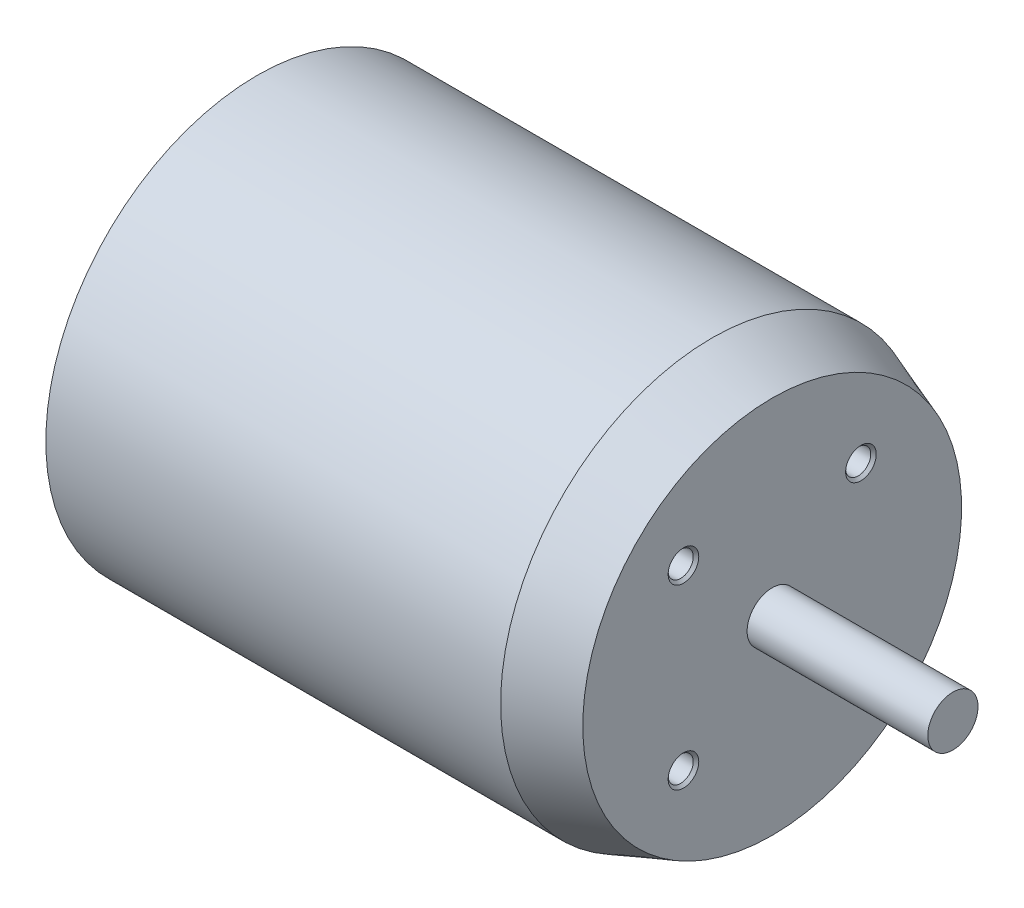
ISO-10303-21;
HEADER;
FILE_DESCRIPTION(('STEP AP214'),'2;1');
FILE_NAME('part.step','',(''),(''),'','','');
FILE_SCHEMA(('AUTOMOTIVE_DESIGN { 1 0 10303 214 1 1 1 1 }'));
ENDSEC;
DATA;
#1=APPLICATION_CONTEXT('core data for automotive mechanical design processes');
#2=APPLICATION_PROTOCOL_DEFINITION('international standard','automotive_design',2000,#1);
#3=PRODUCT_CONTEXT('',#1,'mechanical');
#4=PRODUCT('Part','Part','',(#3));
#5=PRODUCT_RELATED_PRODUCT_CATEGORY('part','',(#4));
#6=PRODUCT_DEFINITION_FORMATION('','',#4);
#7=PRODUCT_DEFINITION_CONTEXT('part definition',#1,'design');
#8=PRODUCT_DEFINITION('design','',#6,#7);
#9=PRODUCT_DEFINITION_SHAPE('','',#8);
#10=(LENGTH_UNIT() NAMED_UNIT(*) SI_UNIT(.MILLI.,.METRE.));
#11=(NAMED_UNIT(*) PLANE_ANGLE_UNIT() SI_UNIT($,.RADIAN.));
#12=(NAMED_UNIT(*) SI_UNIT($,.STERADIAN.) SOLID_ANGLE_UNIT());
#13=UNCERTAINTY_MEASURE_WITH_UNIT(LENGTH_MEASURE(1.E-05),#10,'distance_accuracy_value','');
#14=(GEOMETRIC_REPRESENTATION_CONTEXT(3) GLOBAL_UNCERTAINTY_ASSIGNED_CONTEXT((#13)) GLOBAL_UNIT_ASSIGNED_CONTEXT((#10,
#11,#12)) REPRESENTATION_CONTEXT('',''));
#15=CARTESIAN_POINT('',(0.,0.,0.));
#16=DIRECTION('',(0.,0.,1.));
#17=DIRECTION('',(1.,0.,0.));
#18=AXIS2_PLACEMENT_3D('',#15,#16,#17);
#19=CARTESIAN_POINT('',(58.3,0.,0.));
#20=DIRECTION('',(-1.,0.,0.));
#21=DIRECTION('',(0.,-1.,0.));
#22=AXIS2_PLACEMENT_3D('',#19,#20,#21);
#23=CONICAL_SURFACE('',#22,18.8661785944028,0.349065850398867);
#24=CARTESIAN_POINT('',(52.3,0.,0.));
#25=DIRECTION('',(-1.,0.,0.));
#26=DIRECTION('',(0.,-1.,0.));
#27=AXIS2_PLACEMENT_3D('',#24,#25,#26);
#28=CIRCLE('',#27,21.05);
#29=CARTESIAN_POINT('',(52.3,-21.05,0.));
#30=VERTEX_POINT('',#29);
#31=EDGE_CURVE('E101',#30,#30,#28,.T.);
#32=ORIENTED_EDGE('',*,*,#31,.F.);
#33=EDGE_LOOP('',(#32));
#34=FACE_BOUND('',#33,.T.);
#35=CARTESIAN_POINT('',(58.3,0.,0.));
#36=DIRECTION('',(-1.,0.,0.));
#37=DIRECTION('',(0.,-1.,0.));
#38=AXIS2_PLACEMENT_3D('',#35,#36,#37);
#39=CIRCLE('',#38,18.8661785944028);
#40=CARTESIAN_POINT('',(58.3,-18.8661785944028,0.));
#41=VERTEX_POINT('',#40);
#42=EDGE_CURVE('E11',#41,#41,#39,.T.);
#43=ORIENTED_EDGE('',*,*,#42,.T.);
#44=EDGE_LOOP('',(#43));
#45=FACE_BOUND('',#44,.T.);
#46=ADVANCED_FACE('F37',(#34,#45),#23,.T.);
#47=CARTESIAN_POINT('',(58.3,18.8661785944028,0.));
#48=DIRECTION('',(-1.,0.,0.));
#49=DIRECTION('',(0.,-1.,0.));
#50=AXIS2_PLACEMENT_3D('',#47,#48,#49);
#51=PLANE('',#50);
#52=CARTESIAN_POINT('',(58.3,-8.83883476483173,-8.83883476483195));
#53=DIRECTION('',(1.,0.,0.));
#54=DIRECTION('',(0.,0.,-1.));
#55=AXIS2_PLACEMENT_3D('',#52,#53,#54);
#56=CIRCLE('',#55,1.525);
#57=CARTESIAN_POINT('',(58.3,-8.83883476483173,-10.363834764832));
#58=VERTEX_POINT('',#57);
#59=EDGE_CURVE('E74',#58,#58,#56,.T.);
#60=ORIENTED_EDGE('',*,*,#59,.F.);
#61=EDGE_LOOP('',(#60));
#62=FACE_BOUND('',#61,.T.);
#63=CARTESIAN_POINT('',(58.3,-8.83883476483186,8.83883476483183));
#64=DIRECTION('',(1.,0.,0.));
#65=DIRECTION('',(0.,0.,-1.));
#66=AXIS2_PLACEMENT_3D('',#63,#64,#65);
#67=CIRCLE('',#66,1.525);
#68=CARTESIAN_POINT('',(58.3,-8.83883476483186,7.31383476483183));
#69=VERTEX_POINT('',#68);
#70=EDGE_CURVE('E67',#69,#69,#67,.T.);
#71=ORIENTED_EDGE('',*,*,#70,.F.);
#72=EDGE_LOOP('',(#71));
#73=FACE_BOUND('',#72,.T.);
#74=CARTESIAN_POINT('',(58.3,8.83883476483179,8.83883476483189));
#75=DIRECTION('',(1.,0.,0.));
#76=DIRECTION('',(0.,0.,-1.));
#77=AXIS2_PLACEMENT_3D('',#74,#75,#76);
#78=CIRCLE('',#77,1.525);
#79=CARTESIAN_POINT('',(58.3,8.83883476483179,7.31383476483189));
#80=VERTEX_POINT('',#79);
#81=EDGE_CURVE('E83',#80,#80,#78,.T.);
#82=ORIENTED_EDGE('',*,*,#81,.F.);
#83=EDGE_LOOP('',(#82));
#84=FACE_BOUND('',#83,.T.);
#85=CARTESIAN_POINT('',(58.3,8.83883476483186,-8.83883476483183));
#86=DIRECTION('',(1.,0.,0.));
#87=DIRECTION('',(0.,0.,-1.));
#88=AXIS2_PLACEMENT_3D('',#85,#86,#87);
#89=CIRCLE('',#88,1.525);
#90=CARTESIAN_POINT('',(58.3,8.83883476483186,-10.3638347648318));
#91=VERTEX_POINT('',#90);
#92=EDGE_CURVE('E92',#91,#91,#89,.T.);
#93=ORIENTED_EDGE('',*,*,#92,.F.);
#94=EDGE_LOOP('',(#93));
#95=FACE_BOUND('',#94,.T.);
#96=ORIENTED_EDGE('',*,*,#42,.F.);
#97=EDGE_LOOP('',(#96));
#98=FACE_BOUND('',#97,.T.);
#99=CARTESIAN_POINT('',(58.3,0.,0.));
#100=DIRECTION('',(-1.,0.,0.));
#101=DIRECTION('',(0.,-1.,0.));
#102=AXIS2_PLACEMENT_3D('',#99,#100,#101);
#103=CIRCLE('',#102,2.5);
#104=CARTESIAN_POINT('',(58.3,-2.5,0.));
#105=VERTEX_POINT('',#104);
#106=EDGE_CURVE('E44',#105,#105,#103,.T.);
#107=ORIENTED_EDGE('',*,*,#106,.T.);
#108=EDGE_LOOP('',(#107));
#109=FACE_BOUND('',#108,.T.);
#110=ADVANCED_FACE('F118',(#62,#73,#84,#95,#98,#109),#51,.F.);
#111=CARTESIAN_POINT('',(-55.1177310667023,0.,0.));
#112=DIRECTION('',(-1.,0.,0.));
#113=DIRECTION('',(0.,-1.,0.));
#114=AXIS2_PLACEMENT_3D('',#111,#112,#113);
#115=CYLINDRICAL_SURFACE('',#114,2.5);
#116=ORIENTED_EDGE('',*,*,#106,.F.);
#117=EDGE_LOOP('',(#116));
#118=FACE_BOUND('',#117,.T.);
#119=CARTESIAN_POINT('',(76.3,0.,0.));
#120=DIRECTION('',(-1.,0.,0.));
#121=DIRECTION('',(0.,-1.,0.));
#122=AXIS2_PLACEMENT_3D('',#119,#120,#121);
#123=CIRCLE('',#122,2.5);
#124=CARTESIAN_POINT('',(76.3,-2.5,0.));
#125=VERTEX_POINT('',#124);
#126=EDGE_CURVE('E113',#125,#125,#123,.T.);
#127=ORIENTED_EDGE('',*,*,#126,.T.);
#128=EDGE_LOOP('',(#127));
#129=FACE_BOUND('',#128,.T.);
#130=ADVANCED_FACE('F120',(#118,#129),#115,.T.);
#131=CARTESIAN_POINT('',(76.3,2.5,0.));
#132=DIRECTION('',(-1.,0.,0.));
#133=DIRECTION('',(0.,-1.,0.));
#134=AXIS2_PLACEMENT_3D('',#131,#132,#133);
#135=PLANE('',#134);
#136=ORIENTED_EDGE('',*,*,#126,.F.);
#137=EDGE_LOOP('',(#136));
#138=FACE_BOUND('',#137,.T.);
#139=ADVANCED_FACE('F123',(#138),#135,.F.);
#140=CARTESIAN_POINT('',(0.,0.,0.));
#141=DIRECTION('',(1.,0.,0.));
#142=DIRECTION('',(0.,1.,0.));
#143=AXIS2_PLACEMENT_3D('',#140,#141,#142);
#144=PLANE('',#143);
#145=CARTESIAN_POINT('',(0.,0.,0.));
#146=DIRECTION('',(-1.,0.,0.));
#147=DIRECTION('',(0.,-1.,0.));
#148=AXIS2_PLACEMENT_3D('',#145,#146,#147);
#149=CIRCLE('',#148,5.5);
#150=CARTESIAN_POINT('',(0.,-5.5,0.));
#151=VERTEX_POINT('',#150);
#152=EDGE_CURVE('E110',#151,#151,#149,.T.);
#153=ORIENTED_EDGE('',*,*,#152,.T.);
#154=EDGE_LOOP('',(#153));
#155=FACE_BOUND('',#154,.T.);
#156=ADVANCED_FACE('F128',(#155),#144,.F.);
#157=CARTESIAN_POINT('',(-55.1177310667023,0.,0.));
#158=DIRECTION('',(-1.,0.,0.));
#159=DIRECTION('',(0.,-1.,0.));
#160=AXIS2_PLACEMENT_3D('',#157,#158,#159);
#161=CYLINDRICAL_SURFACE('',#160,5.5);
#162=ORIENTED_EDGE('',*,*,#152,.F.);
#163=EDGE_LOOP('',(#162));
#164=FACE_BOUND('',#163,.T.);
#165=CARTESIAN_POINT('',(7.,0.,0.));
#166=DIRECTION('',(-1.,0.,0.));
#167=DIRECTION('',(0.,-1.,0.));
#168=AXIS2_PLACEMENT_3D('',#165,#166,#167);
#169=CIRCLE('',#168,5.5);
#170=CARTESIAN_POINT('',(7.,-5.5,0.));
#171=VERTEX_POINT('',#170);
#172=EDGE_CURVE('E107',#171,#171,#169,.T.);
#173=ORIENTED_EDGE('',*,*,#172,.T.);
#174=EDGE_LOOP('',(#173));
#175=FACE_BOUND('',#174,.T.);
#176=ADVANCED_FACE('F133',(#164,#175),#161,.T.);
#177=CARTESIAN_POINT('',(7.,5.5,0.));
#178=DIRECTION('',(1.,0.,0.));
#179=DIRECTION('',(0.,1.,0.));
#180=AXIS2_PLACEMENT_3D('',#177,#178,#179);
#181=PLANE('',#180);
#182=ORIENTED_EDGE('',*,*,#172,.F.);
#183=EDGE_LOOP('',(#182));
#184=FACE_BOUND('',#183,.T.);
#185=CARTESIAN_POINT('',(7.,0.,0.));
#186=DIRECTION('',(-1.,0.,0.));
#187=DIRECTION('',(0.,-1.,0.));
#188=AXIS2_PLACEMENT_3D('',#185,#186,#187);
#189=CIRCLE('',#188,21.05);
#190=CARTESIAN_POINT('',(7.,-21.05,0.));
#191=VERTEX_POINT('',#190);
#192=EDGE_CURVE('E104',#191,#191,#189,.T.);
#193=ORIENTED_EDGE('',*,*,#192,.T.);
#194=EDGE_LOOP('',(#193));
#195=FACE_BOUND('',#194,.T.);
#196=ADVANCED_FACE('F150',(#184,#195),#181,.F.);
#197=CARTESIAN_POINT('',(-55.1177310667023,0.,0.));
#198=DIRECTION('',(-1.,0.,0.));
#199=DIRECTION('',(0.,-1.,0.));
#200=AXIS2_PLACEMENT_3D('',#197,#198,#199);
#201=CYLINDRICAL_SURFACE('',#200,21.05);
#202=ORIENTED_EDGE('',*,*,#192,.F.);
#203=EDGE_LOOP('',(#202));
#204=FACE_BOUND('',#203,.T.);
#205=ORIENTED_EDGE('',*,*,#31,.T.);
#206=EDGE_LOOP('',(#205));
#207=FACE_BOUND('',#206,.T.);
#208=ADVANCED_FACE('F147',(#204,#207),#201,.T.);
#209=CARTESIAN_POINT('',(49.8,8.83883476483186,-8.83883476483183));
#210=DIRECTION('',(1.,0.,0.));
#211=DIRECTION('',(0.,0.,-1.));
#212=AXIS2_PLACEMENT_3D('',#209,#210,#211);
#213=CONICAL_SURFACE('',#212,1.24999999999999,1.02974425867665);
#214=CARTESIAN_POINT('',(49.0489242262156,8.83883476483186,-8.83883476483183));
#215=VERTEX_POINT('',#214);
#216=VERTEX_LOOP('',#215);
#217=FACE_BOUND('',#216,.T.);
#218=CARTESIAN_POINT('',(49.8,8.83883476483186,-8.83883476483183));
#219=DIRECTION('',(1.,0.,0.));
#220=DIRECTION('',(0.,0.,-1.));
#221=AXIS2_PLACEMENT_3D('',#218,#219,#220);
#222=CIRCLE('',#221,1.24999999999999);
#223=CARTESIAN_POINT('',(49.8,8.83883476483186,-10.0888347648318));
#224=VERTEX_POINT('',#223);
#225=EDGE_CURVE('E98',#224,#224,#222,.T.);
#226=ORIENTED_EDGE('',*,*,#225,.T.);
#227=EDGE_LOOP('',(#226));
#228=FACE_BOUND('',#227,.T.);
#229=ADVANCED_FACE('F149',(#217,#228),#213,.F.);
#230=CARTESIAN_POINT('',(58.3,8.83883476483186,-8.83883476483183));
#231=DIRECTION('',(1.,0.,0.));
#232=DIRECTION('',(0.,0.,-1.));
#233=AXIS2_PLACEMENT_3D('',#230,#231,#232);
#234=CYLINDRICAL_SURFACE('',#233,1.24999999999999);
#235=ORIENTED_EDGE('',*,*,#225,.F.);
#236=EDGE_LOOP('',(#235));
#237=FACE_BOUND('',#236,.T.);
#238=CARTESIAN_POINT('',(58.025,8.83883476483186,-8.83883476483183));
#239=DIRECTION('',(1.,0.,0.));
#240=DIRECTION('',(0.,0.,-1.));
#241=AXIS2_PLACEMENT_3D('',#238,#239,#240);
#242=CIRCLE('',#241,1.25);
#243=CARTESIAN_POINT('',(58.025,8.83883476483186,-10.0888347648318));
#244=VERTEX_POINT('',#243);
#245=EDGE_CURVE('E95',#244,#244,#242,.T.);
#246=ORIENTED_EDGE('',*,*,#245,.T.);
#247=EDGE_LOOP('',(#246));
#248=FACE_BOUND('',#247,.T.);
#249=ADVANCED_FACE('F157',(#237,#248),#234,.F.);
#250=CARTESIAN_POINT('',(58.3,8.83883476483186,-8.83883476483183));
#251=DIRECTION('',(1.,0.,0.));
#252=DIRECTION('',(0.,0.,-1.));
#253=AXIS2_PLACEMENT_3D('',#250,#251,#252);
#254=CONICAL_SURFACE('',#253,1.525,0.785398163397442);
#255=ORIENTED_EDGE('',*,*,#245,.F.);
#256=EDGE_LOOP('',(#255));
#257=FACE_BOUND('',#256,.T.);
#258=ORIENTED_EDGE('',*,*,#92,.T.);
#259=EDGE_LOOP('',(#258));
#260=FACE_BOUND('',#259,.T.);
#261=ADVANCED_FACE('F201',(#257,#260),#254,.F.);
#262=CARTESIAN_POINT('',(49.8,8.83883476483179,8.83883476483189));
#263=DIRECTION('',(1.,0.,0.));
#264=DIRECTION('',(0.,0.,-1.));
#265=AXIS2_PLACEMENT_3D('',#262,#263,#264);
#266=CONICAL_SURFACE('',#265,1.24999999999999,1.02974425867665);
#267=CARTESIAN_POINT('',(49.0489242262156,8.83883476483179,8.83883476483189));
#268=VERTEX_POINT('',#267);
#269=VERTEX_LOOP('',#268);
#270=FACE_BOUND('',#269,.T.);
#271=CARTESIAN_POINT('',(49.8,8.83883476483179,8.83883476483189));
#272=DIRECTION('',(1.,0.,0.));
#273=DIRECTION('',(0.,0.,-1.));
#274=AXIS2_PLACEMENT_3D('',#271,#272,#273);
#275=CIRCLE('',#274,1.24999999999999);
#276=CARTESIAN_POINT('',(49.8,8.83883476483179,7.5888347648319));
#277=VERTEX_POINT('',#276);
#278=EDGE_CURVE('E89',#277,#277,#275,.T.);
#279=ORIENTED_EDGE('',*,*,#278,.T.);
#280=EDGE_LOOP('',(#279));
#281=FACE_BOUND('',#280,.T.);
#282=ADVANCED_FACE('F212',(#270,#281),#266,.F.);
#283=CARTESIAN_POINT('',(58.3,8.83883476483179,8.83883476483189));
#284=DIRECTION('',(1.,0.,0.));
#285=DIRECTION('',(0.,0.,-1.));
#286=AXIS2_PLACEMENT_3D('',#283,#284,#285);
#287=CYLINDRICAL_SURFACE('',#286,1.24999999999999);
#288=ORIENTED_EDGE('',*,*,#278,.F.);
#289=EDGE_LOOP('',(#288));
#290=FACE_BOUND('',#289,.T.);
#291=CARTESIAN_POINT('',(58.025,8.83883476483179,8.83883476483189));
#292=DIRECTION('',(1.,0.,0.));
#293=DIRECTION('',(0.,0.,-1.));
#294=AXIS2_PLACEMENT_3D('',#291,#292,#293);
#295=CIRCLE('',#294,1.25);
#296=CARTESIAN_POINT('',(58.025,8.83883476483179,7.58883476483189));
#297=VERTEX_POINT('',#296);
#298=EDGE_CURVE('E86',#297,#297,#295,.T.);
#299=ORIENTED_EDGE('',*,*,#298,.T.);
#300=EDGE_LOOP('',(#299));
#301=FACE_BOUND('',#300,.T.);
#302=ADVANCED_FACE('F230',(#290,#301),#287,.F.);
#303=CARTESIAN_POINT('',(58.3,8.83883476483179,8.83883476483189));
#304=DIRECTION('',(1.,0.,0.));
#305=DIRECTION('',(0.,0.,-1.));
#306=AXIS2_PLACEMENT_3D('',#303,#304,#305);
#307=CONICAL_SURFACE('',#306,1.525,0.785398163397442);
#308=ORIENTED_EDGE('',*,*,#298,.F.);
#309=EDGE_LOOP('',(#308));
#310=FACE_BOUND('',#309,.T.);
#311=ORIENTED_EDGE('',*,*,#81,.T.);
#312=EDGE_LOOP('',(#311));
#313=FACE_BOUND('',#312,.T.);
#314=ADVANCED_FACE('F240',(#310,#313),#307,.F.);
#315=CARTESIAN_POINT('',(49.8,-8.83883476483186,8.83883476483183));
#316=DIRECTION('',(1.,0.,0.));
#317=DIRECTION('',(0.,0.,-1.));
#318=AXIS2_PLACEMENT_3D('',#315,#316,#317);
#319=CONICAL_SURFACE('',#318,1.24999999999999,1.02974425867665);
#320=CARTESIAN_POINT('',(49.0489242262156,-8.83883476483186,8.83883476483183));
#321=VERTEX_POINT('',#320);
#322=VERTEX_LOOP('',#321);
#323=FACE_BOUND('',#322,.T.);
#324=CARTESIAN_POINT('',(49.8,-8.83883476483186,8.83883476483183));
#325=DIRECTION('',(1.,0.,0.));
#326=DIRECTION('',(0.,0.,-1.));
#327=AXIS2_PLACEMENT_3D('',#324,#325,#326);
#328=CIRCLE('',#327,1.24999999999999);
#329=CARTESIAN_POINT('',(49.8,-8.83883476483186,7.58883476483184));
#330=VERTEX_POINT('',#329);
#331=EDGE_CURVE('E80',#330,#330,#328,.T.);
#332=ORIENTED_EDGE('',*,*,#331,.T.);
#333=EDGE_LOOP('',(#332));
#334=FACE_BOUND('',#333,.T.);
#335=ADVANCED_FACE('F252',(#323,#334),#319,.F.);
#336=CARTESIAN_POINT('',(58.3,-8.83883476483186,8.83883476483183));
#337=DIRECTION('',(1.,0.,0.));
#338=DIRECTION('',(0.,0.,-1.));
#339=AXIS2_PLACEMENT_3D('',#336,#337,#338);
#340=CYLINDRICAL_SURFACE('',#339,1.24999999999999);
#341=ORIENTED_EDGE('',*,*,#331,.F.);
#342=EDGE_LOOP('',(#341));
#343=FACE_BOUND('',#342,.T.);
#344=CARTESIAN_POINT('',(58.025,-8.83883476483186,8.83883476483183));
#345=DIRECTION('',(1.,0.,0.));
#346=DIRECTION('',(0.,0.,-1.));
#347=AXIS2_PLACEMENT_3D('',#344,#345,#346);
#348=CIRCLE('',#347,1.25);
#349=CARTESIAN_POINT('',(58.025,-8.83883476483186,7.58883476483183));
#350=VERTEX_POINT('',#349);
#351=EDGE_CURVE('E71',#350,#350,#348,.T.);
#352=ORIENTED_EDGE('',*,*,#351,.T.);
#353=EDGE_LOOP('',(#352));
#354=FACE_BOUND('',#353,.T.);
#355=ADVANCED_FACE('F262',(#343,#354),#340,.F.);
#356=CARTESIAN_POINT('',(58.3,-8.83883476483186,8.83883476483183));
#357=DIRECTION('',(1.,0.,0.));
#358=DIRECTION('',(0.,0.,-1.));
#359=AXIS2_PLACEMENT_3D('',#356,#357,#358);
#360=CONICAL_SURFACE('',#359,1.525,0.785398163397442);
#361=ORIENTED_EDGE('',*,*,#351,.F.);
#362=EDGE_LOOP('',(#361));
#363=FACE_BOUND('',#362,.T.);
#364=ORIENTED_EDGE('',*,*,#70,.T.);
#365=EDGE_LOOP('',(#364));
#366=FACE_BOUND('',#365,.T.);
#367=ADVANCED_FACE('F61',(#363,#366),#360,.F.);
#368=CARTESIAN_POINT('',(49.8,-8.83883476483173,-8.83883476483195));
#369=DIRECTION('',(1.,0.,0.));
#370=DIRECTION('',(0.,0.,-1.));
#371=AXIS2_PLACEMENT_3D('',#368,#369,#370);
#372=CONICAL_SURFACE('',#371,1.24999999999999,1.02974425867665);
#373=CARTESIAN_POINT('',(49.0489242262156,-8.83883476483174,-8.83883476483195));
#374=VERTEX_POINT('',#373);
#375=VERTEX_LOOP('',#374);
#376=FACE_BOUND('',#375,.T.);
#377=CARTESIAN_POINT('',(49.8,-8.83883476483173,-8.83883476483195));
#378=DIRECTION('',(1.,0.,0.));
#379=DIRECTION('',(0.,0.,-1.));
#380=AXIS2_PLACEMENT_3D('',#377,#378,#379);
#381=CIRCLE('',#380,1.24999999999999);
#382=CARTESIAN_POINT('',(49.8,-8.83883476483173,-10.0888347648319));
#383=VERTEX_POINT('',#382);
#384=EDGE_CURVE('E65',#383,#383,#381,.T.);
#385=ORIENTED_EDGE('',*,*,#384,.T.);
#386=EDGE_LOOP('',(#385));
#387=FACE_BOUND('',#386,.T.);
#388=ADVANCED_FACE('F57',(#376,#387),#372,.F.);
#389=CARTESIAN_POINT('',(58.3,-8.83883476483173,-8.83883476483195));
#390=DIRECTION('',(1.,0.,0.));
#391=DIRECTION('',(0.,0.,-1.));
#392=AXIS2_PLACEMENT_3D('',#389,#390,#391);
#393=CYLINDRICAL_SURFACE('',#392,1.24999999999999);
#394=ORIENTED_EDGE('',*,*,#384,.F.);
#395=EDGE_LOOP('',(#394));
#396=FACE_BOUND('',#395,.T.);
#397=CARTESIAN_POINT('',(58.025,-8.83883476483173,-8.83883476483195));
#398=DIRECTION('',(1.,0.,0.));
#399=DIRECTION('',(0.,0.,-1.));
#400=AXIS2_PLACEMENT_3D('',#397,#398,#399);
#401=CIRCLE('',#400,1.25);
#402=CARTESIAN_POINT('',(58.025,-8.83883476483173,-10.088834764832));
#403=VERTEX_POINT('',#402);
#404=EDGE_CURVE('E68',#403,#403,#401,.T.);
#405=ORIENTED_EDGE('',*,*,#404,.T.);
#406=EDGE_LOOP('',(#405));
#407=FACE_BOUND('',#406,.T.);
#408=ADVANCED_FACE('F60',(#396,#407),#393,.F.);
#409=CARTESIAN_POINT('',(58.3,-8.83883476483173,-8.83883476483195));
#410=DIRECTION('',(1.,0.,0.));
#411=DIRECTION('',(0.,0.,-1.));
#412=AXIS2_PLACEMENT_3D('',#409,#410,#411);
#413=CONICAL_SURFACE('',#412,1.525,0.785398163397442);
#414=ORIENTED_EDGE('',*,*,#404,.F.);
#415=EDGE_LOOP('',(#414));
#416=FACE_BOUND('',#415,.T.);
#417=ORIENTED_EDGE('',*,*,#59,.T.);
#418=EDGE_LOOP('',(#417));
#419=FACE_BOUND('',#418,.T.);
#420=ADVANCED_FACE('F297',(#416,#419),#413,.F.);
#421=CLOSED_SHELL('',(#46,#110,#130,#139,#156,#176,#196,#208,#229,#249,#261,#282,#302,#314,#335,
#355,#367,#388,#408,#420));
#422=MANIFOLD_SOLID_BREP('B2',#421);
#423=ADVANCED_BREP_SHAPE_REPRESENTATION('',(#18,#422),#14);
#424=SHAPE_DEFINITION_REPRESENTATION(#9,#423);
ENDSEC;
END-ISO-10303-21;
